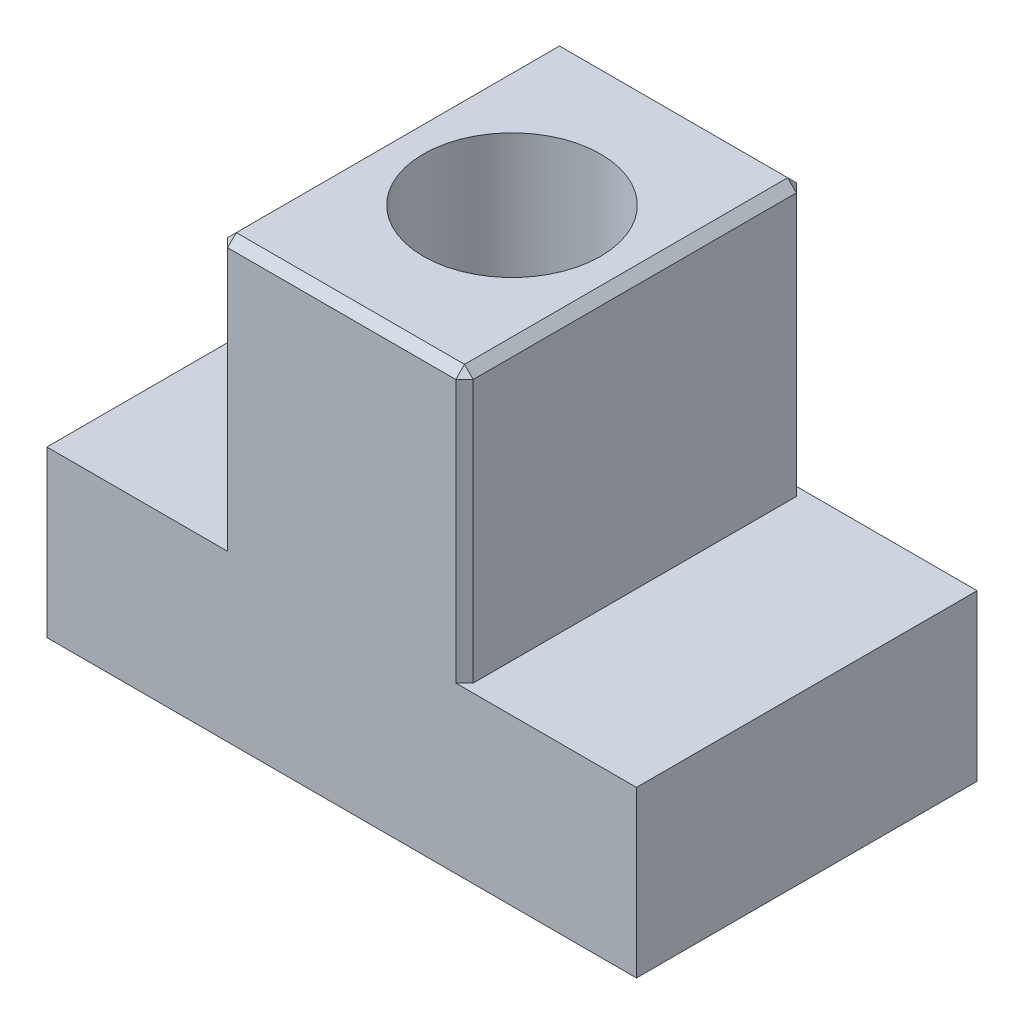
ISO-10303-21;
HEADER;
FILE_DESCRIPTION(('STEP AP214'),'2;1');
FILE_NAME('part.step','',(''),(''),'','','');
FILE_SCHEMA(('AUTOMOTIVE_DESIGN { 1 0 10303 214 1 1 1 1 }'));
ENDSEC;
DATA;
#1=APPLICATION_CONTEXT('core data for automotive mechanical design processes');
#2=APPLICATION_PROTOCOL_DEFINITION('international standard','automotive_design',2000,#1);
#3=PRODUCT_CONTEXT('',#1,'mechanical');
#4=PRODUCT('Part','Part','',(#3));
#5=PRODUCT_RELATED_PRODUCT_CATEGORY('part','',(#4));
#6=PRODUCT_DEFINITION_FORMATION('','',#4);
#7=PRODUCT_DEFINITION_CONTEXT('part definition',#1,'design');
#8=PRODUCT_DEFINITION('design','',#6,#7);
#9=PRODUCT_DEFINITION_SHAPE('','',#8);
#10=(LENGTH_UNIT() NAMED_UNIT(*) SI_UNIT(.MILLI.,.METRE.));
#11=(NAMED_UNIT(*) PLANE_ANGLE_UNIT() SI_UNIT($,.RADIAN.));
#12=(NAMED_UNIT(*) SI_UNIT($,.STERADIAN.) SOLID_ANGLE_UNIT());
#13=UNCERTAINTY_MEASURE_WITH_UNIT(LENGTH_MEASURE(1.E-05),#10,'distance_accuracy_value','');
#14=(GEOMETRIC_REPRESENTATION_CONTEXT(3) GLOBAL_UNCERTAINTY_ASSIGNED_CONTEXT((#13)) GLOBAL_UNIT_ASSIGNED_CONTEXT((#10,
#11,#12)) REPRESENTATION_CONTEXT('',''));
#15=CARTESIAN_POINT('',(0.,0.,0.));
#16=DIRECTION('',(0.,0.,1.));
#17=DIRECTION('',(1.,0.,0.));
#18=AXIS2_PLACEMENT_3D('',#15,#16,#17);
#19=CARTESIAN_POINT('',(0.,0.,0.));
#20=DIRECTION('',(0.,1.,0.));
#21=DIRECTION('',(0.,0.,1.));
#22=AXIS2_PLACEMENT_3D('',#19,#20,#21);
#23=CYLINDRICAL_SURFACE('',#22,5.1562);
#24=CARTESIAN_POINT('',(0.,25.4,0.));
#25=DIRECTION('',(0.,1.,0.));
#26=DIRECTION('',(0.,0.,1.));
#27=AXIS2_PLACEMENT_3D('',#24,#25,#26);
#28=CIRCLE('',#27,5.1562);
#29=CARTESIAN_POINT('',(0.,25.4,5.1562));
#30=VERTEX_POINT('',#29);
#31=EDGE_CURVE('E318',#30,#30,#28,.T.);
#32=ORIENTED_EDGE('',*,*,#31,.T.);
#33=EDGE_LOOP('',(#32));
#34=FACE_BOUND('',#33,.T.);
#35=CARTESIAN_POINT('',(0.,6.35,0.));
#36=DIRECTION('',(0.,-1.,0.));
#37=DIRECTION('',(1.,0.,0.));
#38=AXIS2_PLACEMENT_3D('',#35,#36,#37);
#39=CIRCLE('',#38,5.1562);
#40=CARTESIAN_POINT('',(5.1562,6.35,0.));
#41=VERTEX_POINT('',#40);
#42=EDGE_CURVE('E36',#41,#41,#39,.F.);
#43=ORIENTED_EDGE('',*,*,#42,.F.);
#44=EDGE_LOOP('',(#43));
#45=FACE_BOUND('',#44,.T.);
#46=ADVANCED_FACE('F32',(#34,#45),#23,.F.);
#47=CARTESIAN_POINT('',(-17.145,0.,9.90600000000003));
#48=DIRECTION('',(1.,0.,0.));
#49=DIRECTION('',(0.,0.,-1.));
#50=AXIS2_PLACEMENT_3D('',#47,#48,#49);
#51=PLANE('',#50);
#52=DIRECTION('',(0.,-1.,0.));
#53=VECTOR('',#52,1.);
#54=CARTESIAN_POINT('',(-17.145,0.,-9.906));
#55=LINE('',#54,#53);
#56=CARTESIAN_POINT('',(-17.145,9.6012,-9.906));
#57=VERTEX_POINT('',#56);
#58=CARTESIAN_POINT('',(-17.145,0.,-9.906));
#59=VERTEX_POINT('',#58);
#60=EDGE_CURVE('E139',#57,#59,#55,.T.);
#61=ORIENTED_EDGE('',*,*,#60,.T.);
#62=DIRECTION('',(0.,0.,-1.));
#63=VECTOR('',#62,1.);
#64=CARTESIAN_POINT('',(-17.145,0.,9.90600000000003));
#65=LINE('',#64,#63);
#66=CARTESIAN_POINT('',(-17.145,0.,9.90600000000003));
#67=VERTEX_POINT('',#66);
#68=EDGE_CURVE('E147',#67,#59,#65,.T.);
#69=ORIENTED_EDGE('',*,*,#68,.F.);
#70=DIRECTION('',(0.,-1.,0.));
#71=VECTOR('',#70,1.);
#72=CARTESIAN_POINT('',(-17.145,0.,9.90600000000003));
#73=LINE('',#72,#71);
#74=CARTESIAN_POINT('',(-17.145,9.6012,9.90600000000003));
#75=VERTEX_POINT('',#74);
#76=EDGE_CURVE('E171',#75,#67,#73,.T.);
#77=ORIENTED_EDGE('',*,*,#76,.F.);
#78=DIRECTION('',(0.,0.,-1.));
#79=VECTOR('',#78,1.);
#80=CARTESIAN_POINT('',(-17.145,9.6012,9.90600000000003));
#81=LINE('',#80,#79);
#82=EDGE_CURVE('E158',#75,#57,#81,.T.);
#83=ORIENTED_EDGE('',*,*,#82,.T.);
#84=EDGE_LOOP('',(#61,#69,#77,#83));
#85=FACE_BOUND('',#84,.T.);
#86=ADVANCED_FACE('F34',(#85),#51,.F.);
#87=CARTESIAN_POINT('',(-17.145,0.,9.90600000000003));
#88=DIRECTION('',(0.,1.,0.));
#89=DIRECTION('',(-1.,0.,0.));
#90=AXIS2_PLACEMENT_3D('',#87,#88,#89);
#91=PLANE('',#90);
#92=CARTESIAN_POINT('',(0.,0.,0.));
#93=DIRECTION('',(0.,-1.,0.));
#94=DIRECTION('',(1.,0.,0.));
#95=AXIS2_PLACEMENT_3D('',#92,#93,#94);
#96=CIRCLE('',#95,5.5626);
#97=CARTESIAN_POINT('',(5.5626,0.,0.));
#98=VERTEX_POINT('',#97);
#99=EDGE_CURVE('E325',#98,#98,#96,.T.);
#100=ORIENTED_EDGE('',*,*,#99,.F.);
#101=EDGE_LOOP('',(#100));
#102=FACE_BOUND('',#101,.T.);
#103=DIRECTION('',(1.,0.,0.));
#104=VECTOR('',#103,1.);
#105=CARTESIAN_POINT('',(-17.145,0.,-9.906));
#106=LINE('',#105,#104);
#107=CARTESIAN_POINT('',(17.145,0.,-9.906));
#108=VERTEX_POINT('',#107);
#109=EDGE_CURVE('E134',#59,#108,#106,.T.);
#110=ORIENTED_EDGE('',*,*,#109,.T.);
#111=DIRECTION('',(0.,0.,-1.));
#112=VECTOR('',#111,1.);
#113=CARTESIAN_POINT('',(17.145,0.,9.90600000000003));
#114=LINE('',#113,#112);
#115=CARTESIAN_POINT('',(17.145,0.,9.90600000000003));
#116=VERTEX_POINT('',#115);
#117=EDGE_CURVE('E154',#116,#108,#114,.T.);
#118=ORIENTED_EDGE('',*,*,#117,.F.);
#119=DIRECTION('',(1.,0.,0.));
#120=VECTOR('',#119,1.);
#121=CARTESIAN_POINT('',(-17.145,0.,9.90600000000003));
#122=LINE('',#121,#120);
#123=EDGE_CURVE('E149',#67,#116,#122,.T.);
#124=ORIENTED_EDGE('',*,*,#123,.F.);
#125=ORIENTED_EDGE('',*,*,#68,.T.);
#126=EDGE_LOOP('',(#110,#118,#124,#125));
#127=FACE_BOUND('',#126,.T.);
#128=ADVANCED_FACE('F148',(#102,#127),#91,.F.);
#129=CARTESIAN_POINT('',(17.145,9.6012,9.90600000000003));
#130=DIRECTION('',(-1.,0.,0.));
#131=DIRECTION('',(0.,0.,1.));
#132=AXIS2_PLACEMENT_3D('',#129,#130,#131);
#133=PLANE('',#132);
#134=DIRECTION('',(0.,1.,0.));
#135=VECTOR('',#134,1.);
#136=CARTESIAN_POINT('',(17.145,9.6012,-9.906));
#137=LINE('',#136,#135);
#138=CARTESIAN_POINT('',(17.145,9.6012,-9.906));
#139=VERTEX_POINT('',#138);
#140=EDGE_CURVE('E141',#108,#139,#137,.T.);
#141=ORIENTED_EDGE('',*,*,#140,.T.);
#142=DIRECTION('',(0.,0.,-1.));
#143=VECTOR('',#142,1.);
#144=CARTESIAN_POINT('',(17.145,9.6012,9.90600000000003));
#145=LINE('',#144,#143);
#146=CARTESIAN_POINT('',(17.145,9.6012,9.90600000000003));
#147=VERTEX_POINT('',#146);
#148=EDGE_CURVE('E187',#147,#139,#145,.T.);
#149=ORIENTED_EDGE('',*,*,#148,.F.);
#150=DIRECTION('',(0.,1.,0.));
#151=VECTOR('',#150,1.);
#152=CARTESIAN_POINT('',(17.145,9.6012,9.90600000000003));
#153=LINE('',#152,#151);
#154=EDGE_CURVE('E174',#116,#147,#153,.T.);
#155=ORIENTED_EDGE('',*,*,#154,.F.);
#156=ORIENTED_EDGE('',*,*,#117,.T.);
#157=EDGE_LOOP('',(#141,#149,#155,#156));
#158=FACE_BOUND('',#157,.T.);
#159=ADVANCED_FACE('F332',(#158),#133,.F.);
#160=CARTESIAN_POINT('',(7.14375000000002,9.6012,9.90600000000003));
#161=DIRECTION('',(0.,-1.,0.));
#162=DIRECTION('',(0.,0.,-1.));
#163=AXIS2_PLACEMENT_3D('',#160,#161,#162);
#164=PLANE('',#163);
#165=DIRECTION('',(-1.,0.,0.));
#166=VECTOR('',#165,1.);
#167=CARTESIAN_POINT('',(7.14375000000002,9.6012,-9.906));
#168=LINE('',#167,#166);
#169=CARTESIAN_POINT('',(6.63575000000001,9.6012,-9.906));
#170=VERTEX_POINT('',#169);
#171=EDGE_CURVE('E167',#139,#170,#168,.T.);
#172=ORIENTED_EDGE('',*,*,#171,.T.);
#173=DIRECTION('',(0.707106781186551,0.,0.707106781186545));
#174=VECTOR('',#173,1.);
#175=CARTESIAN_POINT('',(16.79575,9.6012,0.253999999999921));
#176=LINE('',#175,#174);
#177=CARTESIAN_POINT('',(7.14375000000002,9.6012,-9.39799999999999));
#178=VERTEX_POINT('',#177);
#179=EDGE_CURVE('E226',#170,#178,#176,.T.);
#180=ORIENTED_EDGE('',*,*,#179,.T.);
#181=DIRECTION('',(0.,0.,-1.));
#182=VECTOR('',#181,1.);
#183=CARTESIAN_POINT('',(7.14375000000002,9.6012,9.90600000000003));
#184=LINE('',#183,#182);
#185=CARTESIAN_POINT('',(7.14375000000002,9.6012,9.39800000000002));
#186=VERTEX_POINT('',#185);
#187=EDGE_CURVE('E184',#186,#178,#184,.T.);
#188=ORIENTED_EDGE('',*,*,#187,.F.);
#189=DIRECTION('',(0.707106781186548,0.,-0.707106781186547));
#190=VECTOR('',#189,1.);
#191=CARTESIAN_POINT('',(6.88974999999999,9.6012,9.65199999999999));
#192=LINE('',#191,#190);
#193=CARTESIAN_POINT('',(6.63575000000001,9.6012,9.90600000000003));
#194=VERTEX_POINT('',#193);
#195=EDGE_CURVE('E223',#186,#194,#192,.F.);
#196=ORIENTED_EDGE('',*,*,#195,.T.);
#197=DIRECTION('',(-1.,0.,0.));
#198=VECTOR('',#197,1.);
#199=CARTESIAN_POINT('',(7.14375000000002,9.6012,9.90600000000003));
#200=LINE('',#199,#198);
#201=EDGE_CURVE('E176',#147,#194,#200,.T.);
#202=ORIENTED_EDGE('',*,*,#201,.F.);
#203=ORIENTED_EDGE('',*,*,#148,.T.);
#204=EDGE_LOOP('',(#172,#180,#188,#196,#202,#203));
#205=FACE_BOUND('',#204,.T.);
#206=ADVANCED_FACE('F302',(#205),#164,.F.);
#207=CARTESIAN_POINT('',(7.14374999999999,25.4,9.90600000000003));
#208=DIRECTION('',(-1.,0.,0.));
#209=DIRECTION('',(0.,-1.,0.));
#210=AXIS2_PLACEMENT_3D('',#207,#208,#209);
#211=PLANE('',#210);
#212=DIRECTION('',(0.,0.,1.));
#213=VECTOR('',#212,1.);
#214=CARTESIAN_POINT('',(7.14374999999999,24.892,9.90600000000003));
#215=LINE('',#214,#213);
#216=CARTESIAN_POINT('',(7.14374999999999,24.892,-9.39799999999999));
#217=VERTEX_POINT('',#216);
#218=CARTESIAN_POINT('',(7.14374999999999,24.892,9.39800000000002));
#219=VERTEX_POINT('',#218);
#220=EDGE_CURVE('E213',#217,#219,#215,.T.);
#221=ORIENTED_EDGE('',*,*,#220,.T.);
#222=DIRECTION('',(0.,-1.,0.));
#223=VECTOR('',#222,1.);
#224=CARTESIAN_POINT('',(7.14374999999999,25.4,9.39800000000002));
#225=LINE('',#224,#223);
#226=EDGE_CURVE('E217',#219,#186,#225,.T.);
#227=ORIENTED_EDGE('',*,*,#226,.T.);
#228=ORIENTED_EDGE('',*,*,#187,.T.);
#229=DIRECTION('',(0.,1.,0.));
#230=VECTOR('',#229,1.);
#231=CARTESIAN_POINT('',(7.14374999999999,25.4,-9.39799999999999));
#232=LINE('',#231,#230);
#233=EDGE_CURVE('E215',#178,#217,#232,.T.);
#234=ORIENTED_EDGE('',*,*,#233,.T.);
#235=EDGE_LOOP('',(#221,#227,#228,#234));
#236=FACE_BOUND('',#235,.T.);
#237=ADVANCED_FACE('F298',(#236),#211,.F.);
#238=CARTESIAN_POINT('',(-7.14374999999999,25.4,9.90600000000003));
#239=DIRECTION('',(0.,-1.,0.));
#240=DIRECTION('',(0.,0.,-1.));
#241=AXIS2_PLACEMENT_3D('',#238,#239,#240);
#242=PLANE('',#241);
#243=ORIENTED_EDGE('',*,*,#31,.F.);
#244=EDGE_LOOP('',(#243));
#245=FACE_BOUND('',#244,.T.);
#246=DIRECTION('',(0.,0.,-1.));
#247=VECTOR('',#246,1.);
#248=CARTESIAN_POINT('',(6.63575000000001,25.4,9.90600000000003));
#249=LINE('',#248,#247);
#250=CARTESIAN_POINT('',(6.63575000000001,25.4,9.39800000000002));
#251=VERTEX_POINT('',#250);
#252=CARTESIAN_POINT('',(6.63575000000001,25.4,-9.39799999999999));
#253=VERTEX_POINT('',#252);
#254=EDGE_CURVE('E194',#251,#253,#249,.T.);
#255=ORIENTED_EDGE('',*,*,#254,.T.);
#256=DIRECTION('',(-1.,0.,0.));
#257=VECTOR('',#256,1.);
#258=CARTESIAN_POINT('',(-7.14374999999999,25.4,-9.39799999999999));
#259=LINE('',#258,#257);
#260=CARTESIAN_POINT('',(-6.63575000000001,25.4,-9.39799999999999));
#261=VERTEX_POINT('',#260);
#262=EDGE_CURVE('E196',#253,#261,#259,.T.);
#263=ORIENTED_EDGE('',*,*,#262,.T.);
#264=DIRECTION('',(0.,0.,1.));
#265=VECTOR('',#264,1.);
#266=CARTESIAN_POINT('',(-6.63575000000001,25.4,9.90600000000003));
#267=LINE('',#266,#265);
#268=CARTESIAN_POINT('',(-6.63575000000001,25.4,9.39800000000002));
#269=VERTEX_POINT('',#268);
#270=EDGE_CURVE('E153',#261,#269,#267,.T.);
#271=ORIENTED_EDGE('',*,*,#270,.T.);
#272=DIRECTION('',(1.,0.,0.));
#273=VECTOR('',#272,1.);
#274=CARTESIAN_POINT('',(-7.14374999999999,25.4,9.39800000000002));
#275=LINE('',#274,#273);
#276=EDGE_CURVE('E192',#269,#251,#275,.T.);
#277=ORIENTED_EDGE('',*,*,#276,.T.);
#278=EDGE_LOOP('',(#255,#263,#271,#277));
#279=FACE_BOUND('',#278,.T.);
#280=ADVANCED_FACE('F314',(#245,#279),#242,.F.);
#281=CARTESIAN_POINT('',(-7.14374999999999,9.6012,9.90600000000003));
#282=DIRECTION('',(1.,0.,0.));
#283=DIRECTION('',(0.,0.,-1.));
#284=AXIS2_PLACEMENT_3D('',#281,#282,#283);
#285=PLANE('',#284);
#286=DIRECTION('',(0.,0.,-1.));
#287=VECTOR('',#286,1.);
#288=CARTESIAN_POINT('',(-7.14374999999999,9.6012,9.90600000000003));
#289=LINE('',#288,#287);
#290=CARTESIAN_POINT('',(-7.14374999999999,9.6012,9.39800000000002));
#291=VERTEX_POINT('',#290);
#292=CARTESIAN_POINT('',(-7.14374999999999,9.6012,-9.39799999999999));
#293=VERTEX_POINT('',#292);
#294=EDGE_CURVE('E181',#291,#293,#289,.T.);
#295=ORIENTED_EDGE('',*,*,#294,.F.);
#296=DIRECTION('',(0.,1.,0.));
#297=VECTOR('',#296,1.);
#298=CARTESIAN_POINT('',(-7.14374999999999,9.6012,9.39800000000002));
#299=LINE('',#298,#297);
#300=CARTESIAN_POINT('',(-7.14374999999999,24.892,9.39800000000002));
#301=VERTEX_POINT('',#300);
#302=EDGE_CURVE('E48',#291,#301,#299,.T.);
#303=ORIENTED_EDGE('',*,*,#302,.T.);
#304=DIRECTION('',(0.,0.,-1.));
#305=VECTOR('',#304,1.);
#306=CARTESIAN_POINT('',(-7.14374999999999,24.892,9.90600000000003));
#307=LINE('',#306,#305);
#308=CARTESIAN_POINT('',(-7.14374999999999,24.892,-9.39799999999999));
#309=VERTEX_POINT('',#308);
#310=EDGE_CURVE('E53',#301,#309,#307,.T.);
#311=ORIENTED_EDGE('',*,*,#310,.T.);
#312=DIRECTION('',(0.,-1.,0.));
#313=VECTOR('',#312,1.);
#314=CARTESIAN_POINT('',(-7.14374999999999,9.6012,-9.39799999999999));
#315=LINE('',#314,#313);
#316=EDGE_CURVE('E219',#309,#293,#315,.T.);
#317=ORIENTED_EDGE('',*,*,#316,.T.);
#318=EDGE_LOOP('',(#295,#303,#311,#317));
#319=FACE_BOUND('',#318,.T.);
#320=ADVANCED_FACE('F234',(#319),#285,.F.);
#321=CARTESIAN_POINT('',(-17.145,9.6012,9.90600000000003));
#322=DIRECTION('',(0.,-1.,0.));
#323=DIRECTION('',(0.,0.,-1.));
#324=AXIS2_PLACEMENT_3D('',#321,#322,#323);
#325=PLANE('',#324);
#326=DIRECTION('',(-1.,0.,0.));
#327=VECTOR('',#326,1.);
#328=CARTESIAN_POINT('',(-17.145,9.6012,-9.906));
#329=LINE('',#328,#327);
#330=CARTESIAN_POINT('',(-6.63575000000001,9.6012,-9.906));
#331=VERTEX_POINT('',#330);
#332=EDGE_CURVE('E169',#331,#57,#329,.T.);
#333=ORIENTED_EDGE('',*,*,#332,.T.);
#334=ORIENTED_EDGE('',*,*,#82,.F.);
#335=DIRECTION('',(-1.,0.,0.));
#336=VECTOR('',#335,1.);
#337=CARTESIAN_POINT('',(-17.145,9.6012,9.90600000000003));
#338=LINE('',#337,#336);
#339=CARTESIAN_POINT('',(-6.63575000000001,9.6012,9.90600000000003));
#340=VERTEX_POINT('',#339);
#341=EDGE_CURVE('E178',#340,#75,#338,.T.);
#342=ORIENTED_EDGE('',*,*,#341,.F.);
#343=DIRECTION('',(0.707106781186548,0.,0.707106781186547));
#344=VECTOR('',#343,1.);
#345=CARTESIAN_POINT('',(-11.890375,9.6012,4.65137500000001));
#346=LINE('',#345,#344);
#347=EDGE_CURVE('E41',#340,#291,#346,.F.);
#348=ORIENTED_EDGE('',*,*,#347,.T.);
#349=ORIENTED_EDGE('',*,*,#294,.T.);
#350=DIRECTION('',(0.707106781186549,0.,-0.707106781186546));
#351=VECTOR('',#350,1.);
#352=CARTESIAN_POINT('',(-21.796375,9.6012,5.25462499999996));
#353=LINE('',#352,#351);
#354=EDGE_CURVE('E11',#293,#331,#353,.T.);
#355=ORIENTED_EDGE('',*,*,#354,.T.);
#356=EDGE_LOOP('',(#333,#334,#342,#348,#349,#355));
#357=FACE_BOUND('',#356,.T.);
#358=ADVANCED_FACE('F230',(#357),#325,.F.);
#359=CARTESIAN_POINT('',(-17.145,9.6012,9.90600000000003));
#360=DIRECTION('',(0.,0.,-1.));
#361=DIRECTION('',(-1.,0.,0.));
#362=AXIS2_PLACEMENT_3D('',#359,#360,#361);
#363=PLANE('',#362);
#364=ORIENTED_EDGE('',*,*,#201,.T.);
#365=DIRECTION('',(0.,1.,0.));
#366=VECTOR('',#365,1.);
#367=CARTESIAN_POINT('',(6.63575000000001,9.6012,9.90600000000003));
#368=LINE('',#367,#366);
#369=CARTESIAN_POINT('',(6.63575000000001,24.892,9.90600000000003));
#370=VERTEX_POINT('',#369);
#371=EDGE_CURVE('E211',#194,#370,#368,.T.);
#372=ORIENTED_EDGE('',*,*,#371,.T.);
#373=DIRECTION('',(-1.,0.,0.));
#374=VECTOR('',#373,1.);
#375=CARTESIAN_POINT('',(-17.145,24.892,9.90600000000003));
#376=LINE('',#375,#374);
#377=CARTESIAN_POINT('',(-6.63575000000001,24.892,9.90600000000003));
#378=VERTEX_POINT('',#377);
#379=EDGE_CURVE('E209',#370,#378,#376,.T.);
#380=ORIENTED_EDGE('',*,*,#379,.T.);
#381=DIRECTION('',(0.,-1.,0.));
#382=VECTOR('',#381,1.);
#383=CARTESIAN_POINT('',(-6.63575000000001,9.6012,9.90600000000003));
#384=LINE('',#383,#382);
#385=EDGE_CURVE('E206',#378,#340,#384,.T.);
#386=ORIENTED_EDGE('',*,*,#385,.T.);
#387=ORIENTED_EDGE('',*,*,#341,.T.);
#388=ORIENTED_EDGE('',*,*,#76,.T.);
#389=ORIENTED_EDGE('',*,*,#123,.T.);
#390=ORIENTED_EDGE('',*,*,#154,.T.);
#391=EDGE_LOOP('',(#364,#372,#380,#386,#387,#388,#389,#390));
#392=FACE_BOUND('',#391,.T.);
#393=ADVANCED_FACE('F378',(#392),#363,.F.);
#394=CARTESIAN_POINT('',(-17.145,9.6012,-9.906));
#395=DIRECTION('',(0.,0.,-1.));
#396=DIRECTION('',(-1.,0.,0.));
#397=AXIS2_PLACEMENT_3D('',#394,#395,#396);
#398=PLANE('',#397);
#399=DIRECTION('',(0.,-1.,0.));
#400=VECTOR('',#399,1.);
#401=CARTESIAN_POINT('',(6.63575000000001,9.6012,-9.906));
#402=LINE('',#401,#400);
#403=CARTESIAN_POINT('',(6.63575000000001,24.892,-9.906));
#404=VERTEX_POINT('',#403);
#405=EDGE_CURVE('E204',#404,#170,#402,.T.);
#406=ORIENTED_EDGE('',*,*,#405,.T.);
#407=ORIENTED_EDGE('',*,*,#171,.F.);
#408=ORIENTED_EDGE('',*,*,#140,.F.);
#409=ORIENTED_EDGE('',*,*,#109,.F.);
#410=ORIENTED_EDGE('',*,*,#60,.F.);
#411=ORIENTED_EDGE('',*,*,#332,.F.);
#412=DIRECTION('',(0.,1.,0.));
#413=VECTOR('',#412,1.);
#414=CARTESIAN_POINT('',(-6.63575000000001,25.4,-9.906));
#415=LINE('',#414,#413);
#416=CARTESIAN_POINT('',(-6.63575000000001,24.892,-9.906));
#417=VERTEX_POINT('',#416);
#418=EDGE_CURVE('E199',#331,#417,#415,.T.);
#419=ORIENTED_EDGE('',*,*,#418,.T.);
#420=DIRECTION('',(1.,0.,0.));
#421=VECTOR('',#420,1.);
#422=CARTESIAN_POINT('',(7.14374999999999,24.892,-9.906));
#423=LINE('',#422,#421);
#424=EDGE_CURVE('E201',#417,#404,#423,.T.);
#425=ORIENTED_EDGE('',*,*,#424,.T.);
#426=EDGE_LOOP('',(#406,#407,#408,#409,#410,#411,#419,#425));
#427=FACE_BOUND('',#426,.T.);
#428=ADVANCED_FACE('F137',(#427),#398,.T.);
#429=CARTESIAN_POINT('',(6.63575000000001,9.6012,9.90600000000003));
#430=DIRECTION('',(-0.707106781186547,0.,-0.707106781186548));
#431=DIRECTION('',(-0.707106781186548,0.,0.707106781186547));
#432=AXIS2_PLACEMENT_3D('',#429,#430,#431);
#433=PLANE('',#432);
#434=ORIENTED_EDGE('',*,*,#195,.F.);
#435=ORIENTED_EDGE('',*,*,#226,.F.);
#436=DIRECTION('',(-0.707106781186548,0.,0.707106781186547));
#437=VECTOR('',#436,1.);
#438=CARTESIAN_POINT('',(6.63575000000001,24.892,9.90600000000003));
#439=LINE('',#438,#437);
#440=EDGE_CURVE('E159',#370,#219,#439,.F.);
#441=ORIENTED_EDGE('',*,*,#440,.F.);
#442=ORIENTED_EDGE('',*,*,#371,.F.);
#443=EDGE_LOOP('',(#434,#435,#441,#442));
#444=FACE_BOUND('',#443,.T.);
#445=ADVANCED_FACE('F295',(#444),#433,.F.);
#446=CARTESIAN_POINT('',(-17.145,24.892,9.90600000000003));
#447=DIRECTION('',(0.,-0.707106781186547,-0.707106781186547));
#448=DIRECTION('',(0.,0.707106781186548,-0.707106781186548));
#449=AXIS2_PLACEMENT_3D('',#446,#447,#448);
#450=PLANE('',#449);
#451=DIRECTION('',(0.,-0.707106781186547,0.707106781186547));
#452=VECTOR('',#451,1.);
#453=CARTESIAN_POINT('',(-6.63575000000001,24.892,9.90600000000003));
#454=LINE('',#453,#452);
#455=EDGE_CURVE('E242',#378,#269,#454,.F.);
#456=ORIENTED_EDGE('',*,*,#455,.F.);
#457=ORIENTED_EDGE('',*,*,#379,.F.);
#458=DIRECTION('',(0.,0.707106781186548,-0.707106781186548));
#459=VECTOR('',#458,1.);
#460=CARTESIAN_POINT('',(6.63575000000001,24.892,9.90600000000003));
#461=LINE('',#460,#459);
#462=EDGE_CURVE('E162',#251,#370,#461,.F.);
#463=ORIENTED_EDGE('',*,*,#462,.F.);
#464=ORIENTED_EDGE('',*,*,#276,.F.);
#465=EDGE_LOOP('',(#456,#457,#463,#464));
#466=FACE_BOUND('',#465,.T.);
#467=ADVANCED_FACE('F289',(#466),#450,.F.);
#468=CARTESIAN_POINT('',(-6.63575000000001,9.6012,9.90600000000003));
#469=DIRECTION('',(0.707106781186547,0.,-0.707106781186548));
#470=DIRECTION('',(-0.707106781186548,0.,-0.707106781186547));
#471=AXIS2_PLACEMENT_3D('',#468,#469,#470);
#472=PLANE('',#471);
#473=ORIENTED_EDGE('',*,*,#347,.F.);
#474=ORIENTED_EDGE('',*,*,#385,.F.);
#475=DIRECTION('',(-0.707106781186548,0.,-0.707106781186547));
#476=VECTOR('',#475,1.);
#477=CARTESIAN_POINT('',(-6.63575000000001,24.892,9.90600000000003));
#478=LINE('',#477,#476);
#479=EDGE_CURVE('E237',#301,#378,#478,.F.);
#480=ORIENTED_EDGE('',*,*,#479,.F.);
#481=ORIENTED_EDGE('',*,*,#302,.F.);
#482=EDGE_LOOP('',(#473,#474,#480,#481));
#483=FACE_BOUND('',#482,.T.);
#484=ADVANCED_FACE('F235',(#483),#472,.F.);
#485=CARTESIAN_POINT('',(6.63575000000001,24.892,9.90600000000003));
#486=DIRECTION('',(0.577350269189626,0.577350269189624,0.577350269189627));
#487=DIRECTION('',(0.707106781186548,0.,-0.707106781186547));
#488=AXIS2_PLACEMENT_3D('',#485,#486,#487);
#489=PLANE('',#488);
#490=ORIENTED_EDGE('',*,*,#462,.T.);
#491=ORIENTED_EDGE('',*,*,#440,.T.);
#492=DIRECTION('',(0.707106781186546,-0.707106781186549,0.));
#493=VECTOR('',#492,1.);
#494=CARTESIAN_POINT('',(6.88974999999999,25.146,9.39800000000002));
#495=LINE('',#494,#493);
#496=EDGE_CURVE('E243',#251,#219,#495,.T.);
#497=ORIENTED_EDGE('',*,*,#496,.F.);
#498=EDGE_LOOP('',(#490,#491,#497));
#499=FACE_BOUND('',#498,.T.);
#500=ADVANCED_FACE('F283',(#499),#489,.T.);
#501=CARTESIAN_POINT('',(-6.63575000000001,24.892,9.90600000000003));
#502=DIRECTION('',(-0.577350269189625,0.577350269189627,0.577350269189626));
#503=DIRECTION('',(0.,-0.707106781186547,0.707106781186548));
#504=AXIS2_PLACEMENT_3D('',#501,#502,#503);
#505=PLANE('',#504);
#506=ORIENTED_EDGE('',*,*,#479,.T.);
#507=ORIENTED_EDGE('',*,*,#455,.T.);
#508=DIRECTION('',(0.707106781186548,0.707106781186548,0.));
#509=VECTOR('',#508,1.);
#510=CARTESIAN_POINT('',(-6.88974999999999,25.146,9.39800000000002));
#511=LINE('',#510,#509);
#512=EDGE_CURVE('E246',#301,#269,#511,.T.);
#513=ORIENTED_EDGE('',*,*,#512,.F.);
#514=EDGE_LOOP('',(#506,#507,#513));
#515=FACE_BOUND('',#514,.T.);
#516=ADVANCED_FACE('F247',(#515),#505,.T.);
#517=CARTESIAN_POINT('',(7.14374999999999,25.4,-9.39799999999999));
#518=DIRECTION('',(0.707106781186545,0.,-0.707106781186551));
#519=DIRECTION('',(-0.707106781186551,0.,-0.707106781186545));
#520=AXIS2_PLACEMENT_3D('',#517,#518,#519);
#521=PLANE('',#520);
#522=ORIENTED_EDGE('',*,*,#179,.F.);
#523=ORIENTED_EDGE('',*,*,#405,.F.);
#524=DIRECTION('',(-0.70710678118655,0.,-0.707106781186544));
#525=VECTOR('',#524,1.);
#526=CARTESIAN_POINT('',(6.63575000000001,24.892,-9.906));
#527=LINE('',#526,#525);
#528=EDGE_CURVE('E250',#217,#404,#527,.T.);
#529=ORIENTED_EDGE('',*,*,#528,.F.);
#530=ORIENTED_EDGE('',*,*,#233,.F.);
#531=EDGE_LOOP('',(#522,#523,#529,#530));
#532=FACE_BOUND('',#531,.T.);
#533=ADVANCED_FACE('F307',(#532),#521,.T.);
#534=CARTESIAN_POINT('',(6.63575000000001,25.4,9.90600000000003));
#535=DIRECTION('',(-0.707106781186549,-0.707106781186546,0.));
#536=DIRECTION('',(0.707106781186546,-0.707106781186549,0.));
#537=AXIS2_PLACEMENT_3D('',#534,#535,#536);
#538=PLANE('',#537);
#539=ORIENTED_EDGE('',*,*,#496,.T.);
#540=ORIENTED_EDGE('',*,*,#220,.F.);
#541=DIRECTION('',(-0.707106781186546,0.707106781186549,0.));
#542=VECTOR('',#541,1.);
#543=CARTESIAN_POINT('',(6.88974999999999,25.146,-9.39799999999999));
#544=LINE('',#543,#542);
#545=EDGE_CURVE('E259',#253,#217,#544,.F.);
#546=ORIENTED_EDGE('',*,*,#545,.F.);
#547=ORIENTED_EDGE('',*,*,#254,.F.);
#548=EDGE_LOOP('',(#539,#540,#546,#547));
#549=FACE_BOUND('',#548,.T.);
#550=ADVANCED_FACE('F311',(#549),#538,.F.);
#551=CARTESIAN_POINT('',(-7.14374999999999,24.892,9.90600000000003));
#552=DIRECTION('',(0.707106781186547,-0.707106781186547,0.));
#553=DIRECTION('',(0.707106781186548,0.707106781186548,0.));
#554=AXIS2_PLACEMENT_3D('',#551,#552,#553);
#555=PLANE('',#554);
#556=ORIENTED_EDGE('',*,*,#512,.T.);
#557=ORIENTED_EDGE('',*,*,#270,.F.);
#558=DIRECTION('',(-0.707106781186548,-0.707106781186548,0.));
#559=VECTOR('',#558,1.);
#560=CARTESIAN_POINT('',(-6.63575000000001,25.4,-9.39799999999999));
#561=LINE('',#560,#559);
#562=EDGE_CURVE('E255',#309,#261,#561,.F.);
#563=ORIENTED_EDGE('',*,*,#562,.F.);
#564=ORIENTED_EDGE('',*,*,#310,.F.);
#565=EDGE_LOOP('',(#556,#557,#563,#564));
#566=FACE_BOUND('',#565,.T.);
#567=ADVANCED_FACE('F253',(#566),#555,.F.);
#568=CARTESIAN_POINT('',(-7.14374999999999,9.6012,-9.39799999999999));
#569=DIRECTION('',(-0.707106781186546,0.,-0.707106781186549));
#570=DIRECTION('',(-0.707106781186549,0.,0.707106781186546));
#571=AXIS2_PLACEMENT_3D('',#568,#569,#570);
#572=PLANE('',#571);
#573=ORIENTED_EDGE('',*,*,#354,.F.);
#574=ORIENTED_EDGE('',*,*,#316,.F.);
#575=DIRECTION('',(-0.707106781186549,0.,0.707106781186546));
#576=VECTOR('',#575,1.);
#577=CARTESIAN_POINT('',(-6.88974999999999,24.892,-9.65199999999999));
#578=LINE('',#577,#576);
#579=EDGE_CURVE('E260',#417,#309,#578,.T.);
#580=ORIENTED_EDGE('',*,*,#579,.F.);
#581=ORIENTED_EDGE('',*,*,#418,.F.);
#582=EDGE_LOOP('',(#573,#574,#580,#581));
#583=FACE_BOUND('',#582,.T.);
#584=ADVANCED_FACE('F356',(#583),#572,.T.);
#585=CARTESIAN_POINT('',(6.63575000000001,24.892,-9.906));
#586=DIRECTION('',(0.577350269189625,0.577350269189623,-0.57735026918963));
#587=DIRECTION('',(-0.707106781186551,0.,-0.707106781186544));
#588=AXIS2_PLACEMENT_3D('',#585,#586,#587);
#589=PLANE('',#588);
#590=ORIENTED_EDGE('',*,*,#545,.T.);
#591=ORIENTED_EDGE('',*,*,#528,.T.);
#592=DIRECTION('',(0.,0.70710678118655,0.707106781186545));
#593=VECTOR('',#592,1.);
#594=CARTESIAN_POINT('',(6.63575000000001,24.892,-9.906));
#595=LINE('',#594,#593);
#596=EDGE_CURVE('E268',#253,#404,#595,.F.);
#597=ORIENTED_EDGE('',*,*,#596,.F.);
#598=EDGE_LOOP('',(#590,#591,#597));
#599=FACE_BOUND('',#598,.T.);
#600=ADVANCED_FACE('F353',(#599),#589,.T.);
#601=CARTESIAN_POINT('',(-6.63575000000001,25.4,-9.39799999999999));
#602=DIRECTION('',(-0.577350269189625,0.577350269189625,-0.577350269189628));
#603=DIRECTION('',(-0.707106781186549,0.,0.707106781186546));
#604=AXIS2_PLACEMENT_3D('',#601,#602,#603);
#605=PLANE('',#604);
#606=ORIENTED_EDGE('',*,*,#579,.T.);
#607=ORIENTED_EDGE('',*,*,#562,.T.);
#608=DIRECTION('',(0.,-0.70710678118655,-0.707106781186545));
#609=VECTOR('',#608,1.);
#610=CARTESIAN_POINT('',(-6.63575000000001,25.4,-9.39799999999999));
#611=LINE('',#610,#609);
#612=EDGE_CURVE('E264',#417,#261,#611,.F.);
#613=ORIENTED_EDGE('',*,*,#612,.F.);
#614=EDGE_LOOP('',(#606,#607,#613));
#615=FACE_BOUND('',#614,.T.);
#616=ADVANCED_FACE('F263',(#615),#605,.T.);
#617=CARTESIAN_POINT('',(-7.14374999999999,25.4,-9.39799999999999));
#618=DIRECTION('',(0.,0.707106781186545,-0.70710678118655));
#619=DIRECTION('',(0.,0.70710678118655,0.707106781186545));
#620=AXIS2_PLACEMENT_3D('',#617,#618,#619);
#621=PLANE('',#620);
#622=ORIENTED_EDGE('',*,*,#596,.T.);
#623=ORIENTED_EDGE('',*,*,#424,.F.);
#624=ORIENTED_EDGE('',*,*,#612,.T.);
#625=ORIENTED_EDGE('',*,*,#262,.F.);
#626=EDGE_LOOP('',(#622,#623,#624,#625));
#627=FACE_BOUND('',#626,.T.);
#628=ADVANCED_FACE('F317',(#627),#621,.T.);
#629=CARTESIAN_POINT('',(0.,6.35,0.));
#630=DIRECTION('',(0.,-1.,0.));
#631=DIRECTION('',(1.,0.,0.));
#632=AXIS2_PLACEMENT_3D('',#629,#630,#631);
#633=PLANE('',#632);
#634=CARTESIAN_POINT('',(0.,6.35,0.));
#635=DIRECTION('',(0.,-1.,0.));
#636=DIRECTION('',(1.,0.,0.));
#637=AXIS2_PLACEMENT_3D('',#634,#635,#636);
#638=CIRCLE('',#637,5.5626);
#639=CARTESIAN_POINT('',(5.5626,6.35,0.));
#640=VERTEX_POINT('',#639);
#641=EDGE_CURVE('E322',#640,#640,#638,.T.);
#642=ORIENTED_EDGE('',*,*,#641,.T.);
#643=EDGE_LOOP('',(#642));
#644=FACE_BOUND('',#643,.T.);
#645=ORIENTED_EDGE('',*,*,#42,.T.);
#646=EDGE_LOOP('',(#645));
#647=FACE_BOUND('',#646,.T.);
#648=ADVANCED_FACE('F350',(#644,#647),#633,.T.);
#649=CARTESIAN_POINT('',(0.,6.35,0.));
#650=DIRECTION('',(0.,-1.,0.));
#651=DIRECTION('',(1.,0.,0.));
#652=AXIS2_PLACEMENT_3D('',#649,#650,#651);
#653=CYLINDRICAL_SURFACE('',#652,5.5626);
#654=ORIENTED_EDGE('',*,*,#641,.F.);
#655=EDGE_LOOP('',(#654));
#656=FACE_BOUND('',#655,.T.);
#657=ORIENTED_EDGE('',*,*,#99,.T.);
#658=EDGE_LOOP('',(#657));
#659=FACE_BOUND('',#658,.T.);
#660=ADVANCED_FACE('F329',(#656,#659),#653,.F.);
#661=CLOSED_SHELL('',(#46,#86,#128,#159,#206,#237,#280,#320,#358,#393,#428,#445,#467,#484,#500,
#516,#533,#550,#567,#584,#600,#616,#628,#648,#660));
#662=MANIFOLD_SOLID_BREP('B2',#661);
#663=ADVANCED_BREP_SHAPE_REPRESENTATION('',(#18,#662),#14);
#664=SHAPE_DEFINITION_REPRESENTATION(#9,#663);
ENDSEC;
END-ISO-10303-21;
